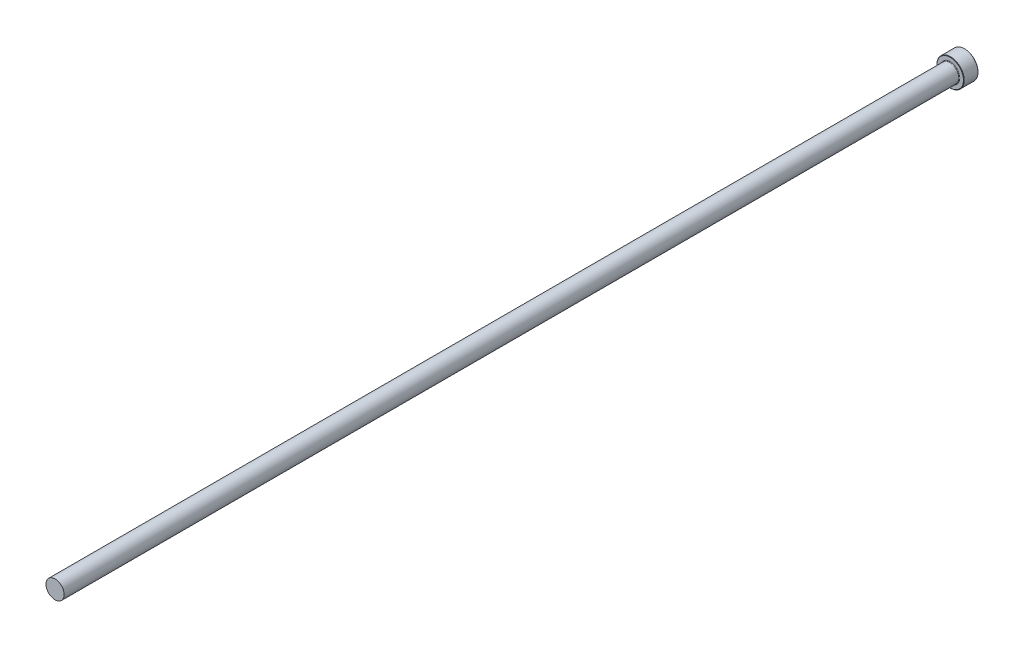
ISO-10303-21;
HEADER;
FILE_DESCRIPTION(('STEP AP214'),'2;1');
FILE_NAME('part.step','',(''),(''),'','','');
FILE_SCHEMA(('AUTOMOTIVE_DESIGN { 1 0 10303 214 1 1 1 1 }'));
ENDSEC;
DATA;
#1=APPLICATION_CONTEXT('core data for automotive mechanical design processes');
#2=APPLICATION_PROTOCOL_DEFINITION('international standard','automotive_design',2000,#1);
#3=PRODUCT_CONTEXT('',#1,'mechanical');
#4=PRODUCT('Part','Part','',(#3));
#5=PRODUCT_RELATED_PRODUCT_CATEGORY('part','',(#4));
#6=PRODUCT_DEFINITION_FORMATION('','',#4);
#7=PRODUCT_DEFINITION_CONTEXT('part definition',#1,'design');
#8=PRODUCT_DEFINITION('design','',#6,#7);
#9=PRODUCT_DEFINITION_SHAPE('','',#8);
#10=(LENGTH_UNIT() NAMED_UNIT(*) SI_UNIT(.MILLI.,.METRE.));
#11=(NAMED_UNIT(*) PLANE_ANGLE_UNIT() SI_UNIT($,.RADIAN.));
#12=(NAMED_UNIT(*) SI_UNIT($,.STERADIAN.) SOLID_ANGLE_UNIT());
#13=UNCERTAINTY_MEASURE_WITH_UNIT(LENGTH_MEASURE(1.E-05),#10,'distance_accuracy_value','');
#14=(GEOMETRIC_REPRESENTATION_CONTEXT(3) GLOBAL_UNCERTAINTY_ASSIGNED_CONTEXT((#13)) GLOBAL_UNIT_ASSIGNED_CONTEXT((#10,
#11,#12)) REPRESENTATION_CONTEXT('',''));
#15=CARTESIAN_POINT('',(0.,0.,0.));
#16=DIRECTION('',(0.,0.,1.));
#17=DIRECTION('',(1.,0.,0.));
#18=AXIS2_PLACEMENT_3D('',#15,#16,#17);
#19=CARTESIAN_POINT('',(0.,4.99999999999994,500.));
#20=DIRECTION('',(0.,0.,-1.));
#21=DIRECTION('',(-1.,0.,0.));
#22=AXIS2_PLACEMENT_3D('',#19,#20,#21);
#23=PLANE('',#22);
#24=CARTESIAN_POINT('',(0.,0.,500.));
#25=DIRECTION('',(0.,0.,1.));
#26=DIRECTION('',(1.,0.,0.));
#27=AXIS2_PLACEMENT_3D('',#24,#25,#26);
#28=CIRCLE('',#27,4.99999999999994);
#29=CARTESIAN_POINT('',(4.99999999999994,0.,500.));
#30=VERTEX_POINT('',#29);
#31=EDGE_CURVE('E50',#30,#30,#28,.T.);
#32=ORIENTED_EDGE('',*,*,#31,.T.);
#33=EDGE_LOOP('',(#32));
#34=FACE_BOUND('',#33,.T.);
#35=ADVANCED_FACE('F30',(#34),#23,.F.);
#36=CARTESIAN_POINT('',(0.,0.,109.050628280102));
#37=DIRECTION('',(0.,0.,1.));
#38=DIRECTION('',(1.,0.,0.));
#39=AXIS2_PLACEMENT_3D('',#36,#37,#38);
#40=CYLINDRICAL_SURFACE('',#39,4.99999999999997);
#41=ORIENTED_EDGE('',*,*,#31,.F.);
#42=EDGE_LOOP('',(#41));
#43=FACE_BOUND('',#42,.T.);
#44=CARTESIAN_POINT('',(0.,0.,8.3));
#45=DIRECTION('',(0.,0.,1.));
#46=DIRECTION('',(1.,0.,0.));
#47=AXIS2_PLACEMENT_3D('',#44,#45,#46);
#48=CIRCLE('',#47,5.);
#49=CARTESIAN_POINT('',(5.,0.,8.3));
#50=VERTEX_POINT('',#49);
#51=EDGE_CURVE('E53',#50,#50,#48,.T.);
#52=ORIENTED_EDGE('',*,*,#51,.T.);
#53=EDGE_LOOP('',(#52));
#54=FACE_BOUND('',#53,.T.);
#55=ADVANCED_FACE('F73',(#43,#54),#40,.T.);
#56=CARTESIAN_POINT('',(0.,0.,8.3));
#57=DIRECTION('',(0.,0.,1.));
#58=DIRECTION('',(1.,0.,0.));
#59=AXIS2_PLACEMENT_3D('',#56,#57,#58);
#60=TOROIDAL_SURFACE('',#59,5.3,0.3);
#61=ORIENTED_EDGE('',*,*,#51,.F.);
#62=EDGE_LOOP('',(#61));
#63=FACE_BOUND('',#62,.T.);
#64=CARTESIAN_POINT('',(0.,0.,8.00000000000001));
#65=DIRECTION('',(0.,0.,1.));
#66=DIRECTION('',(1.,0.,0.));
#67=AXIS2_PLACEMENT_3D('',#64,#65,#66);
#68=CIRCLE('',#67,5.3);
#69=CARTESIAN_POINT('',(5.3,0.,8.00000000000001));
#70=VERTEX_POINT('',#69);
#71=EDGE_CURVE('E56',#70,#70,#68,.T.);
#72=ORIENTED_EDGE('',*,*,#71,.T.);
#73=EDGE_LOOP('',(#72));
#74=FACE_BOUND('',#73,.T.);
#75=ADVANCED_FACE('F60',(#63,#74),#60,.F.);
#76=CARTESIAN_POINT('',(0.,7.5,8.));
#77=DIRECTION('',(0.,0.,-1.));
#78=DIRECTION('',(-1.,0.,0.));
#79=AXIS2_PLACEMENT_3D('',#76,#77,#78);
#80=PLANE('',#79);
#81=CARTESIAN_POINT('',(0.,0.,8.));
#82=DIRECTION('',(0.,0.,-1.));
#83=DIRECTION('',(-1.,0.,0.));
#84=AXIS2_PLACEMENT_3D('',#81,#82,#83);
#85=CIRCLE('',#84,7.29999999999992);
#86=CARTESIAN_POINT('',(-7.29999999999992,0.,8.));
#87=VERTEX_POINT('',#86);
#88=EDGE_CURVE('E10',#87,#87,#85,.F.);
#89=ORIENTED_EDGE('',*,*,#88,.T.);
#90=EDGE_LOOP('',(#89));
#91=FACE_BOUND('',#90,.T.);
#92=ORIENTED_EDGE('',*,*,#71,.F.);
#93=EDGE_LOOP('',(#92));
#94=FACE_BOUND('',#93,.T.);
#95=ADVANCED_FACE('F62',(#91,#94),#80,.F.);
#96=CARTESIAN_POINT('',(0.,0.,109.050628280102));
#97=DIRECTION('',(0.,0.,1.));
#98=DIRECTION('',(1.,0.,0.));
#99=AXIS2_PLACEMENT_3D('',#96,#97,#98);
#100=CYLINDRICAL_SURFACE('',#99,7.5);
#101=CARTESIAN_POINT('',(0.,0.,0.200000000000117));
#102=DIRECTION('',(0.,0.,1.));
#103=DIRECTION('',(1.,0.,0.));
#104=AXIS2_PLACEMENT_3D('',#101,#102,#103);
#105=CIRCLE('',#104,7.5);
#106=CARTESIAN_POINT('',(7.5,0.,0.200000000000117));
#107=VERTEX_POINT('',#106);
#108=EDGE_CURVE('E41',#107,#107,#105,.T.);
#109=ORIENTED_EDGE('',*,*,#108,.T.);
#110=EDGE_LOOP('',(#109));
#111=FACE_BOUND('',#110,.T.);
#112=CARTESIAN_POINT('',(0.,0.,7.79999999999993));
#113=DIRECTION('',(0.,0.,-1.));
#114=DIRECTION('',(-1.,0.,0.));
#115=AXIS2_PLACEMENT_3D('',#112,#113,#114);
#116=CIRCLE('',#115,7.5);
#117=CARTESIAN_POINT('',(-7.5,0.,7.79999999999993));
#118=VERTEX_POINT('',#117);
#119=EDGE_CURVE('E45',#118,#118,#116,.T.);
#120=ORIENTED_EDGE('',*,*,#119,.T.);
#121=EDGE_LOOP('',(#120));
#122=FACE_BOUND('',#121,.T.);
#123=ADVANCED_FACE('F64',(#111,#122),#100,.T.);
#124=CARTESIAN_POINT('',(0.,0.,0.));
#125=DIRECTION('',(0.,0.,1.));
#126=DIRECTION('',(1.,0.,0.));
#127=AXIS2_PLACEMENT_3D('',#124,#125,#126);
#128=PLANE('',#127);
#129=CARTESIAN_POINT('',(0.,0.,0.));
#130=DIRECTION('',(0.,0.,1.));
#131=DIRECTION('',(1.,0.,0.));
#132=AXIS2_PLACEMENT_3D('',#129,#130,#131);
#133=CIRCLE('',#132,7.29999999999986);
#134=CARTESIAN_POINT('',(7.29999999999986,0.,0.));
#135=VERTEX_POINT('',#134);
#136=EDGE_CURVE('E37',#135,#135,#133,.F.);
#137=ORIENTED_EDGE('',*,*,#136,.T.);
#138=EDGE_LOOP('',(#137));
#139=FACE_BOUND('',#138,.T.);
#140=ADVANCED_FACE('F70',(#139),#128,.F.);
#141=CARTESIAN_POINT('',(0.,0.,0.200000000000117));
#142=DIRECTION('',(0.,0.,1.));
#143=DIRECTION('',(1.,0.,0.));
#144=AXIS2_PLACEMENT_3D('',#141,#142,#143);
#145=CONICAL_SURFACE('',#144,7.5,0.785398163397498);
#146=ORIENTED_EDGE('',*,*,#136,.F.);
#147=EDGE_LOOP('',(#146));
#148=FACE_BOUND('',#147,.T.);
#149=ORIENTED_EDGE('',*,*,#108,.F.);
#150=EDGE_LOOP('',(#149));
#151=FACE_BOUND('',#150,.T.);
#152=ADVANCED_FACE('F84',(#148,#151),#145,.T.);
#153=CARTESIAN_POINT('',(0.,0.,8.00000000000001));
#154=DIRECTION('',(0.,0.,-1.));
#155=DIRECTION('',(-1.,0.,0.));
#156=AXIS2_PLACEMENT_3D('',#153,#154,#155);
#157=CONICAL_SURFACE('',#156,7.29999999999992,0.785398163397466);
#158=ORIENTED_EDGE('',*,*,#119,.F.);
#159=EDGE_LOOP('',(#158));
#160=FACE_BOUND('',#159,.T.);
#161=ORIENTED_EDGE('',*,*,#88,.F.);
#162=EDGE_LOOP('',(#161));
#163=FACE_BOUND('',#162,.T.);
#164=ADVANCED_FACE('F32',(#160,#163),#157,.T.);
#165=CLOSED_SHELL('',(#35,#55,#75,#95,#123,#140,#152,#164));
#166=MANIFOLD_SOLID_BREP('B2',#165);
#167=ADVANCED_BREP_SHAPE_REPRESENTATION('',(#18,#166),#14);
#168=SHAPE_DEFINITION_REPRESENTATION(#9,#167);
ENDSEC;
END-ISO-10303-21;
